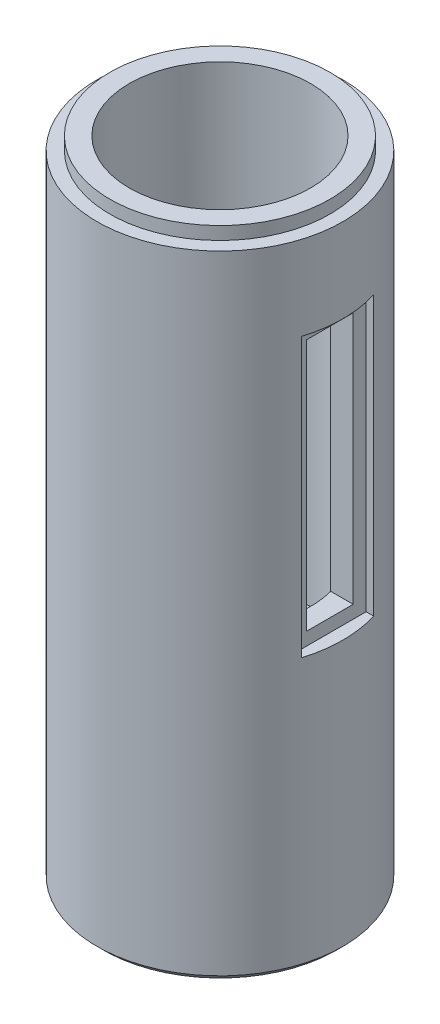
ISO-10303-21;
HEADER;
FILE_DESCRIPTION(('STEP AP214'),'2;1');
FILE_NAME('part.step','',(''),(''),'','','');
FILE_SCHEMA(('AUTOMOTIVE_DESIGN { 1 0 10303 214 1 1 1 1 }'));
ENDSEC;
DATA;
#1=APPLICATION_CONTEXT('core data for automotive mechanical design processes');
#2=APPLICATION_PROTOCOL_DEFINITION('international standard','automotive_design',2000,#1);
#3=PRODUCT_CONTEXT('',#1,'mechanical');
#4=PRODUCT('Part','Part','',(#3));
#5=PRODUCT_RELATED_PRODUCT_CATEGORY('part','',(#4));
#6=PRODUCT_DEFINITION_FORMATION('','',#4);
#7=PRODUCT_DEFINITION_CONTEXT('part definition',#1,'design');
#8=PRODUCT_DEFINITION('design','',#6,#7);
#9=PRODUCT_DEFINITION_SHAPE('','',#8);
#10=(LENGTH_UNIT() NAMED_UNIT(*) SI_UNIT(.MILLI.,.METRE.));
#11=(NAMED_UNIT(*) PLANE_ANGLE_UNIT() SI_UNIT($,.RADIAN.));
#12=(NAMED_UNIT(*) SI_UNIT($,.STERADIAN.) SOLID_ANGLE_UNIT());
#13=UNCERTAINTY_MEASURE_WITH_UNIT(LENGTH_MEASURE(1.E-05),#10,'distance_accuracy_value','');
#14=(GEOMETRIC_REPRESENTATION_CONTEXT(3) GLOBAL_UNCERTAINTY_ASSIGNED_CONTEXT((#13)) GLOBAL_UNIT_ASSIGNED_CONTEXT((#10,
#11,#12)) REPRESENTATION_CONTEXT('',''));
#15=CARTESIAN_POINT('',(0.,0.,0.));
#16=DIRECTION('',(0.,0.,1.));
#17=DIRECTION('',(1.,0.,0.));
#18=AXIS2_PLACEMENT_3D('',#15,#16,#17);
#19=CARTESIAN_POINT('',(0.,0.,0.));
#20=DIRECTION('',(0.,-1.,0.));
#21=DIRECTION('',(0.,0.,-1.));
#22=AXIS2_PLACEMENT_3D('',#19,#20,#21);
#23=CYLINDRICAL_SURFACE('',#22,19.);
#24=DIRECTION('',(0.,-1.,0.));
#25=VECTOR('',#24,1.);
#26=CARTESIAN_POINT('',(18.1598415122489,0.,5.58749999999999));
#27=LINE('',#26,#25);
#28=CARTESIAN_POINT('',(18.1598415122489,85.,5.58749999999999));
#29=VERTEX_POINT('',#28);
#30=CARTESIAN_POINT('',(18.1598415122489,42.,5.58749999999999));
#31=VERTEX_POINT('',#30);
#32=EDGE_CURVE('E11',#29,#31,#27,.T.);
#33=ORIENTED_EDGE('',*,*,#32,.F.);
#34=CARTESIAN_POINT('',(0.,85.,0.));
#35=DIRECTION('',(0.,-1.,0.));
#36=DIRECTION('',(0.,0.,-1.));
#37=AXIS2_PLACEMENT_3D('',#34,#35,#36);
#38=CIRCLE('',#37,19.);
#39=CARTESIAN_POINT('',(18.1598415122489,85.,-5.5875));
#40=VERTEX_POINT('',#39);
#41=EDGE_CURVE('E60',#29,#40,#38,.F.);
#42=ORIENTED_EDGE('',*,*,#41,.T.);
#43=DIRECTION('',(0.,-1.,0.));
#44=VECTOR('',#43,1.);
#45=CARTESIAN_POINT('',(18.1598415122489,0.,-5.5875));
#46=LINE('',#45,#44);
#47=CARTESIAN_POINT('',(18.1598415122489,42.,-5.5875));
#48=VERTEX_POINT('',#47);
#49=EDGE_CURVE('E131',#40,#48,#46,.T.);
#50=ORIENTED_EDGE('',*,*,#49,.T.);
#51=CARTESIAN_POINT('',(0.,42.,0.));
#52=DIRECTION('',(0.,-1.,0.));
#53=DIRECTION('',(0.,0.,-1.));
#54=AXIS2_PLACEMENT_3D('',#51,#52,#53);
#55=CIRCLE('',#54,19.);
#56=EDGE_CURVE('E53',#31,#48,#55,.F.);
#57=ORIENTED_EDGE('',*,*,#56,.F.);
#58=EDGE_LOOP('',(#33,#42,#50,#57));
#59=FACE_BOUND('',#58,.T.);
#60=CARTESIAN_POINT('',(0.,1.00000000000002,0.));
#61=DIRECTION('',(0.,-1.,0.));
#62=DIRECTION('',(0.,0.,-1.));
#63=AXIS2_PLACEMENT_3D('',#60,#61,#62);
#64=CIRCLE('',#63,19.);
#65=CARTESIAN_POINT('',(0.,1.00000000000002,-19.));
#66=VERTEX_POINT('',#65);
#67=EDGE_CURVE('E286',#66,#66,#64,.F.);
#68=ORIENTED_EDGE('',*,*,#67,.T.);
#69=EDGE_LOOP('',(#68));
#70=FACE_BOUND('',#69,.T.);
#71=CARTESIAN_POINT('',(-16.1554944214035,50.,10.));
#72=CARTESIAN_POINT('',(-16.1554939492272,49.7415393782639,10.0000004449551));
#73=CARTESIAN_POINT('',(-16.1617174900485,49.4830827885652,9.98996714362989));
#74=CARTESIAN_POINT('',(-16.1863660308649,48.9682056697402,9.94998001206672));
#75=CARTESIAN_POINT('',(-16.2047958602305,48.7117859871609,9.9200182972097));
#76=CARTESIAN_POINT('',(-16.2531781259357,48.2027520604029,9.84054659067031));
#77=CARTESIAN_POINT('',(-16.283146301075,47.9501435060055,9.7910098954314));
#78=CARTESIAN_POINT('',(-16.3535139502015,47.450770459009,9.67301866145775));
#79=CARTESIAN_POINT('',(-16.3939180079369,47.204008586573,9.6045558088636));
#80=CARTESIAN_POINT('',(-16.4834897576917,46.719483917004,9.4499990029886));
#81=CARTESIAN_POINT('',(-16.5326009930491,46.4816744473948,9.36401812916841));
#82=CARTESIAN_POINT('',(-16.6382633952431,46.0145768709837,9.17496123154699));
#83=CARTESIAN_POINT('',(-16.6948172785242,45.7852919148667,9.07187896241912));
#84=CARTESIAN_POINT('',(-16.8137605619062,45.3363755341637,8.84948290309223));
#85=CARTESIAN_POINT('',(-16.8761490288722,45.1167425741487,8.73017170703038));
#86=CARTESIAN_POINT('',(-17.0051833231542,44.6879309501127,8.4760864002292));
#87=CARTESIAN_POINT('',(-17.07182929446,44.4787526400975,8.34131176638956));
#88=CARTESIAN_POINT('',(-17.2140821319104,44.052854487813,8.04394033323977));
#89=CARTESIAN_POINT('',(-17.2899493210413,43.8372111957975,7.87992463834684));
#90=CARTESIAN_POINT('',(-17.4429455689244,43.4201835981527,7.53519821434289));
#91=CARTESIAN_POINT('',(-17.5200746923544,43.2188000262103,7.35448662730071));
#92=CARTESIAN_POINT('',(-17.6737626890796,42.8310677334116,6.97708029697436));
#93=CARTESIAN_POINT('',(-17.7503211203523,42.6447297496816,6.78037433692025));
#94=CARTESIAN_POINT('',(-17.9009675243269,42.288273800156,6.37202536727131));
#95=CARTESIAN_POINT('',(-17.9750563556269,42.1181501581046,6.16038763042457));
#96=CARTESIAN_POINT('',(-18.1246027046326,41.7826104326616,5.70615894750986));
#97=CARTESIAN_POINT('',(-18.1997255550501,41.6185679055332,5.46243953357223));
#98=CARTESIAN_POINT('',(-18.3430338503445,41.3117729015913,4.95997549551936));
#99=CARTESIAN_POINT('',(-18.4112188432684,41.1690218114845,4.70122989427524));
#100=CARTESIAN_POINT('',(-18.5386543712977,40.9063267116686,4.17045931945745));
#101=CARTESIAN_POINT('',(-18.5979096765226,40.7863705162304,3.89844153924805));
#102=CARTESIAN_POINT('',(-18.7057395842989,40.5706080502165,3.34295002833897));
#103=CARTESIAN_POINT('',(-18.7543154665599,40.4747988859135,3.05947767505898));
#104=CARTESIAN_POINT('',(-18.8359667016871,40.3150645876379,2.50569903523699));
#105=CARTESIAN_POINT('',(-18.8699509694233,40.2492452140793,2.23607260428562));
#106=CARTESIAN_POINT('',(-18.9265718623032,40.1401163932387,1.69112255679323));
#107=CARTESIAN_POINT('',(-18.9492090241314,40.0968058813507,1.41579921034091));
#108=CARTESIAN_POINT('',(-18.9824654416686,40.0333192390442,0.861934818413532));
#109=CARTESIAN_POINT('',(-18.9930915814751,40.013129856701,0.583395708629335));
#110=CARTESIAN_POINT('',(-19.0020311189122,39.99613856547,0.0254154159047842));
#111=CARTESIAN_POINT('',(-19.0003453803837,39.9993350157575,-0.254025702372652));
#112=CARTESIAN_POINT('',(-18.9854710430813,40.0276268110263,-0.784464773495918));
#113=CARTESIAN_POINT('',(-18.9734051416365,40.0505849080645,-1.0356117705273));
#114=CARTESIAN_POINT('',(-18.9395611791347,40.1152774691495,-1.53479379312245));
#115=CARTESIAN_POINT('',(-18.9177838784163,40.1570104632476,-1.7828290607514));
#116=CARTESIAN_POINT('',(-18.8650322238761,40.2587818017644,-2.27411651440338));
#117=CARTESIAN_POINT('',(-18.8340575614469,40.3188207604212,-2.51736853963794));
#118=CARTESIAN_POINT('',(-18.7636238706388,40.4565687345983,-2.99755221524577));
#119=CARTESIAN_POINT('',(-18.7241645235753,40.5342784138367,-3.23448362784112));
#120=CARTESIAN_POINT('',(-18.6371017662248,40.7076774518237,-3.70351242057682));
#121=CARTESIAN_POINT('',(-18.589404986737,40.803574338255,-3.93551573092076));
#122=CARTESIAN_POINT('',(-18.4872422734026,41.0118780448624,-4.39048138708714));
#123=CARTESIAN_POINT('',(-18.4327739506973,41.1242906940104,-4.61344050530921));
#124=CARTESIAN_POINT('',(-18.2609083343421,41.4849727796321,-5.26704267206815));
#125=CARTESIAN_POINT('',(-18.1349950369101,41.7567933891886,-5.68269725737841));
#126=CARTESIAN_POINT('',(-17.8569413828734,42.3869701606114,-6.50673718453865));
#127=CARTESIAN_POINT('',(-17.7034360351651,42.7513159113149,-6.91008319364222));
#128=CARTESIAN_POINT('',(-17.4724880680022,43.3426191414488,-7.46677942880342));
#129=CARTESIAN_POINT('',(-17.3953285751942,43.547365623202,-7.64441344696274));
#130=CARTESIAN_POINT('',(-17.2426495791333,43.9710667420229,-7.98282141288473));
#131=CARTESIAN_POINT('',(-17.1671303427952,44.1900236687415,-8.14359263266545));
#132=CARTESIAN_POINT('',(-17.0141317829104,44.6583422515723,-8.45886165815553));
#133=CARTESIAN_POINT('',(-16.936941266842,44.9087494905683,-8.61194899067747));
#134=CARTESIAN_POINT('',(-16.7893874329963,45.4235078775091,-8.89618490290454));
#135=CARTESIAN_POINT('',(-16.719021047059,45.6878526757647,-9.02734336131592));
#136=CARTESIAN_POINT('',(-16.5877126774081,46.2289232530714,-9.26641209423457));
#137=CARTESIAN_POINT('',(-16.5267646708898,46.505640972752,-9.37433724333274));
#138=CARTESIAN_POINT('',(-16.4167626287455,47.069719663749,-9.56567355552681));
#139=CARTESIAN_POINT('',(-16.3677068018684,47.3570790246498,-9.64908841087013));
#140=CARTESIAN_POINT('',(-16.2871340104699,47.9164875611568,-9.78442427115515));
#141=CARTESIAN_POINT('',(-16.2545190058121,48.1878939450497,-9.83834758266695));
#142=CARTESIAN_POINT('',(-16.2026141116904,48.7355023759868,-9.92359841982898));
#143=CARTESIAN_POINT('',(-16.1833234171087,49.0117041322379,-9.95492731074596));
#144=CARTESIAN_POINT('',(-16.1589467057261,49.5661718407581,-9.99444769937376));
#145=CARTESIAN_POINT('',(-16.1538496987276,49.8444360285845,-10.002657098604));
#146=CARTESIAN_POINT('',(-16.1580679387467,50.4005565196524,-9.99584231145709));
#147=CARTESIAN_POINT('',(-16.167381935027,50.6784128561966,-9.98082014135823));
#148=CARTESIAN_POINT('',(-16.1978940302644,51.1957036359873,-9.93120984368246));
#149=CARTESIAN_POINT('',(-16.2174200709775,51.4355075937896,-9.89936948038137));
#150=CARTESIAN_POINT('',(-16.2664357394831,51.9112652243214,-9.81862006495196));
#151=CARTESIAN_POINT('',(-16.2959286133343,52.1472176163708,-9.76970545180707));
#152=CARTESIAN_POINT('',(-16.3639338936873,52.6137296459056,-9.65536549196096));
#153=CARTESIAN_POINT('',(-16.4024454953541,52.8442897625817,-9.58994161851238));
#154=CARTESIAN_POINT('',(-16.4873442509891,53.298858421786,-9.44323285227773));
#155=CARTESIAN_POINT('',(-16.5337345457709,53.5228643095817,-9.361941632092));
#156=CARTESIAN_POINT('',(-16.6872649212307,54.2029989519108,-9.08738309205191));
#157=CARTESIAN_POINT('',(-16.8055910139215,54.6465402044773,-8.86850653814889));
#158=CARTESIAN_POINT('',(-17.0590424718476,55.4931541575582,-8.37059432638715));
#159=CARTESIAN_POINT('',(-17.1941764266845,55.8962059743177,-8.09152785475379));
#160=CARTESIAN_POINT('',(-17.4104012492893,56.4933025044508,-7.61018272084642));
#161=CARTESIAN_POINT('',(-17.489857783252,56.7029466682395,-7.42618673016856));
#162=CARTESIAN_POINT('',(-17.6483371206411,57.1062075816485,-7.04126843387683));
#163=CARTESIAN_POINT('',(-17.7273600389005,57.2998287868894,-6.84035086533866));
#164=CARTESIAN_POINT('',(-17.8830482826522,57.6701805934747,-6.42233435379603));
#165=CARTESIAN_POINT('',(-17.959711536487,57.8468966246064,-6.20522173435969));
#166=CARTESIAN_POINT('',(-18.1086648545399,58.1820701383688,-5.75605848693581));
#167=CARTESIAN_POINT('',(-18.1809567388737,58.3405352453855,-5.52401416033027));
#168=CARTESIAN_POINT('',(-18.3220311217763,58.6438148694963,-5.03685547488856));
#169=CARTESIAN_POINT('',(-18.3905719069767,58.7878705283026,-4.78119718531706));
#170=CARTESIAN_POINT('',(-18.5190628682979,59.0536859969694,-4.25643860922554));
#171=CARTESIAN_POINT('',(-18.5790126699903,59.1754448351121,-3.98733773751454));
#172=CARTESIAN_POINT('',(-18.6885020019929,59.3951676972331,-3.43777843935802));
#173=CARTESIAN_POINT('',(-18.7380496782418,59.4931503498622,-3.15732910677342));
#174=CARTESIAN_POINT('',(-18.8252475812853,59.6641276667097,-2.58712030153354));
#175=CARTESIAN_POINT('',(-18.8628994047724,59.7371256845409,-2.29736208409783));
#176=CARTESIAN_POINT('',(-18.9220542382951,59.8512062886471,-1.73972820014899));
#177=CARTESIAN_POINT('',(-18.9447740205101,59.8947070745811,-1.47247424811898));
#178=CARTESIAN_POINT('',(-18.9789120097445,59.9599135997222,-0.934606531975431));
#179=CARTESIAN_POINT('',(-18.9903309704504,59.9816207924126,-0.663992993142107));
#180=CARTESIAN_POINT('',(-19.001544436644,60.0029381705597,-0.121757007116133));
#181=CARTESIAN_POINT('',(-19.0013431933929,60.0025564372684,0.149865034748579));
#182=CARTESIAN_POINT('',(-18.989332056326,59.9797208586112,0.691915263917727));
#183=CARTESIAN_POINT('',(-18.9775226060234,59.9572678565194,0.962343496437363));
#184=CARTESIAN_POINT('',(-18.9439918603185,59.8932048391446,1.47879879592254));
#185=CARTESIAN_POINT('',(-18.9231145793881,59.8532238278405,1.72508531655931));
#186=CARTESIAN_POINT('',(-18.8722683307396,59.7552174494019,2.21306535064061));
#187=CARTESIAN_POINT('',(-18.8422999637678,59.6971932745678,2.45475916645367));
#188=CARTESIAN_POINT('',(-18.7739537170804,59.5637137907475,2.9320264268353));
#189=CARTESIAN_POINT('',(-18.7355766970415,59.4882602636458,3.16760049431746));
#190=CARTESIAN_POINT('',(-18.6512331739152,59.3206087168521,3.63140293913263));
#191=CARTESIAN_POINT('',(-18.6052637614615,59.2284042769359,3.85962846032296));
#192=CARTESIAN_POINT('',(-18.504804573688,59.0241895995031,4.31612266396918));
#193=CARTESIAN_POINT('',(-18.4500545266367,58.9115525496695,4.54405339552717));
#194=CARTESIAN_POINT('',(-18.3345802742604,58.6699535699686,4.98960500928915));
#195=CARTESIAN_POINT('',(-18.2738538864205,58.5409856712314,5.20722208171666));
#196=CARTESIAN_POINT('',(-18.1477017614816,58.2676346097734,5.63114884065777));
#197=CARTESIAN_POINT('',(-18.0822753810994,58.1232493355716,5.8374569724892));
#198=CARTESIAN_POINT('',(-17.9480570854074,57.8199265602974,6.23793711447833));
#199=CARTESIAN_POINT('',(-17.8792648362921,57.660987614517,6.43210791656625));
#200=CARTESIAN_POINT('',(-17.7321442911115,57.3114111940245,6.82790748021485));
#201=CARTESIAN_POINT('',(-17.6535897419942,57.1192047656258,7.02806882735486));
#202=CARTESIAN_POINT('',(-17.4960044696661,56.7189299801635,7.41166893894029));
#203=CARTESIAN_POINT('',(-17.4169737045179,56.5108602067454,7.59510620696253));
#204=CARTESIAN_POINT('',(-17.2603958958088,56.0796108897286,7.94452176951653));
#205=CARTESIAN_POINT('',(-17.1828505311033,55.8564154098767,8.11048116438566));
#206=CARTESIAN_POINT('',(-17.0314664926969,55.3961171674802,8.42374124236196));
#207=CARTESIAN_POINT('',(-16.9576275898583,55.1590152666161,8.57104307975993));
#208=CARTESIAN_POINT('',(-16.812368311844,54.6599842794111,8.85271757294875));
#209=CARTESIAN_POINT('',(-16.7412446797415,54.3974077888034,8.98610034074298));
#210=CARTESIAN_POINT('',(-16.608068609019,53.8595103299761,9.22991742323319));
#211=CARTESIAN_POINT('',(-16.5460177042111,53.58418721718,9.34034785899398));
#212=CARTESIAN_POINT('',(-16.4336892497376,53.023465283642,9.53659387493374));
#213=CARTESIAN_POINT('',(-16.3833783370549,52.7380977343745,9.62247936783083));
#214=CARTESIAN_POINT('',(-16.296607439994,52.1589902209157,9.76871785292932));
#215=CARTESIAN_POINT('',(-16.2601381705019,51.8652560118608,9.82908796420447));
#216=CARTESIAN_POINT('',(-16.2064894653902,51.3101704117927,9.91725716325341));
#217=CARTESIAN_POINT('',(-16.1874347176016,51.0495026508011,9.9482426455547));
#218=CARTESIAN_POINT('',(-16.1619371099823,50.5258886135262,9.98961436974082));
#219=CARTESIAN_POINT('',(-16.1554949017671,50.2629422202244,9.99999954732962));
#220=CARTESIAN_POINT('',(-16.1554944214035,50.,10.));
#221=B_SPLINE_CURVE_WITH_KNOTS('',3,(#71,#72,#73,#74,#75,#76,#77,#78,#79,#80,#81,#82,#83,#84,
#85,#86,#87,#88,#89,#90,#91,#92,#93,#94,#95,#96,#97,#98,#99,#100,#101,#102,#103,#104,#105,#106,
#107,#108,#109,#110,#111,#112,#113,#114,#115,#116,#117,#118,#119,#120,#121,#122,#123,#124,#125,
#126,#127,#128,#129,#130,#131,#132,#133,#134,#135,#136,#137,#138,#139,#140,#141,#142,#143,#144,
#145,#146,#147,#148,#149,#150,#151,#152,#153,#154,#155,#156,#157,#158,#159,#160,#161,#162,#163,
#164,#165,#166,#167,#168,#169,#170,#171,#172,#173,#174,#175,#176,#177,#178,#179,#180,#181,#182,
#183,#184,#185,#186,#187,#188,#189,#190,#191,#192,#193,#194,#195,#196,#197,#198,#199,#200,#201,
#202,#203,#204,#205,#206,#207,#208,#209,#210,#211,#212,#213,#214,#215,#216,#217,#218,#219,#220),
.UNSPECIFIED.,.T.,.F.,(4,2,2,2,2,2,2,2,2,2,2,2,2,2,2,2,2,2,2,2,2,2,2,2,2,2,2,2,2,2,2,2,2,2,2,2,
2,2,2,2,2,2,2,2,2,2,2,2,2,2,2,2,2,2,2,2,2,2,2,2,2,2,2,2,2,2,2,2,2,2,2,2,2,2,4),(0.,
0.775108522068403,1.550523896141,2.3270007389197,3.10381921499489,3.87577372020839,
4.64801076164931,5.4201245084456,6.19226438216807,7.03543828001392,7.8786555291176,
8.72246930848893,9.56598659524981,10.4745204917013,11.3831135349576,12.2912194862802,
13.1992165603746,14.0369141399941,14.87457209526,15.7117497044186,16.5488685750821,
17.3054196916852,18.0619115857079,18.8184288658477,19.5749745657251,20.3407379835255,
21.1067723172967,22.6379179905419,24.3247975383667,25.1695866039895,26.0145121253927,
26.9237916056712,27.8326603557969,28.7409454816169,29.6490937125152,30.4837531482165,
31.3183621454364,32.1523247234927,32.9862149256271,33.7134669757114,34.4409561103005,
35.1683803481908,35.8960952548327,37.4154828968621,38.9356502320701,39.8049296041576,
40.6739664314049,41.5437456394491,42.4131601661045,43.3159941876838,44.2188675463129,
45.1210312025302,46.0230737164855,46.8371475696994,47.6511671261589,48.4648888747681,
49.2785795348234,50.0288686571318,50.7791082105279,51.529271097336,52.2797221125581,
53.0591221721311,53.838807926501,54.6186005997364,55.3984707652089,56.2627490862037,
57.1271046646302,57.9923855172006,58.8576128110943,59.7653211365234,60.6731827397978,
61.5784320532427,62.4830730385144,63.2715808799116,64.0601294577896),.UNSPECIFIED.);
#222=CARTESIAN_POINT('',(-16.1554944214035,50.,10.));
#223=VERTEX_POINT('',#222);
#224=EDGE_CURVE('E147',#223,#223,#221,.T.);
#225=ORIENTED_EDGE('',*,*,#224,.T.);
#226=EDGE_LOOP('',(#225));
#227=FACE_BOUND('',#226,.T.);
#228=CARTESIAN_POINT('',(0.,98.,0.));
#229=DIRECTION('',(0.,-1.,0.));
#230=DIRECTION('',(0.,0.,-1.));
#231=AXIS2_PLACEMENT_3D('',#228,#229,#230);
#232=CIRCLE('',#231,19.);
#233=CARTESIAN_POINT('',(0.,98.,-19.));
#234=VERTEX_POINT('',#233);
#235=EDGE_CURVE('E127',#234,#234,#232,.T.);
#236=ORIENTED_EDGE('',*,*,#235,.T.);
#237=EDGE_LOOP('',(#236));
#238=FACE_BOUND('',#237,.T.);
#239=ADVANCED_FACE('F44',(#59,#70,#227,#238),#23,.T.);
#240=CARTESIAN_POINT('',(0.,100.,0.));
#241=DIRECTION('',(0.,1.,0.));
#242=DIRECTION('',(0.,0.,1.));
#243=AXIS2_PLACEMENT_3D('',#240,#241,#242);
#244=PLANE('',#243);
#245=CARTESIAN_POINT('',(0.,100.,0.));
#246=DIRECTION('',(0.,-1.,0.));
#247=DIRECTION('',(0.,0.,-1.));
#248=AXIS2_PLACEMENT_3D('',#245,#246,#247);
#249=CIRCLE('',#248,14.);
#250=CARTESIAN_POINT('',(0.,100.,-14.));
#251=VERTEX_POINT('',#250);
#252=EDGE_CURVE('E279',#251,#251,#249,.T.);
#253=ORIENTED_EDGE('',*,*,#252,.T.);
#254=EDGE_LOOP('',(#253));
#255=FACE_BOUND('',#254,.T.);
#256=CARTESIAN_POINT('',(0.,100.,0.));
#257=DIRECTION('',(0.,-1.,0.));
#258=DIRECTION('',(0.,0.,-1.));
#259=AXIS2_PLACEMENT_3D('',#256,#257,#258);
#260=CIRCLE('',#259,17.);
#261=CARTESIAN_POINT('',(0.,100.,-17.));
#262=VERTEX_POINT('',#261);
#263=EDGE_CURVE('E303',#262,#262,#260,.T.);
#264=ORIENTED_EDGE('',*,*,#263,.F.);
#265=EDGE_LOOP('',(#264));
#266=FACE_BOUND('',#265,.T.);
#267=ADVANCED_FACE('F228',(#255,#266),#244,.T.);
#268=CARTESIAN_POINT('',(0.,0.,0.));
#269=DIRECTION('',(0.,-1.,0.));
#270=DIRECTION('',(0.,0.,-1.));
#271=AXIS2_PLACEMENT_3D('',#268,#269,#270);
#272=CYLINDRICAL_SURFACE('',#271,14.);
#273=CARTESIAN_POINT('',(0.,30.,0.));
#274=DIRECTION('',(0.,-1.,0.));
#275=DIRECTION('',(0.,0.,-1.));
#276=AXIS2_PLACEMENT_3D('',#273,#274,#275);
#277=CIRCLE('',#276,14.);
#278=CARTESIAN_POINT('',(0.,30.,-14.));
#279=VERTEX_POINT('',#278);
#280=EDGE_CURVE('E257',#279,#279,#277,.T.);
#281=ORIENTED_EDGE('',*,*,#280,.T.);
#282=EDGE_LOOP('',(#281));
#283=FACE_BOUND('',#282,.T.);
#284=ORIENTED_EDGE('',*,*,#252,.F.);
#285=EDGE_LOOP('',(#284));
#286=FACE_BOUND('',#285,.T.);
#287=CARTESIAN_POINT('',(-9.79795897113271,50.,10.));
#288=CARTESIAN_POINT('',(-9.79795815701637,49.7617761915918,10.000000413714));
#289=CARTESIAN_POINT('',(-9.8066890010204,49.5235570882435,9.99146857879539));
#290=CARTESIAN_POINT('',(-9.84110892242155,49.049571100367,9.95756740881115));
#291=CARTESIAN_POINT('',(-9.86679850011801,48.8138042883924,9.93219757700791));
#292=CARTESIAN_POINT('',(-9.93381514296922,48.3464244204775,9.86516839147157));
#293=CARTESIAN_POINT('',(-9.97517221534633,48.1148202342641,9.82347777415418));
#294=CARTESIAN_POINT('',(-10.0715520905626,47.6577508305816,9.72463836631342));
#295=CARTESIAN_POINT('',(-10.126582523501,47.4322891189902,9.66748094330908));
#296=CARTESIAN_POINT('',(-10.2472878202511,46.9914577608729,9.53942950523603));
#297=CARTESIAN_POINT('',(-10.3128241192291,46.7759983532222,9.46871223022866));
#298=CARTESIAN_POINT('',(-10.4527885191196,46.3529996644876,9.31397479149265));
#299=CARTESIAN_POINT('',(-10.5272158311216,46.1454596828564,9.22995580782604));
#300=CARTESIAN_POINT('',(-10.760685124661,45.5352703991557,8.95902972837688));
#301=CARTESIAN_POINT('',(-10.9300057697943,45.1447390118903,8.75316092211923));
#302=CARTESIAN_POINT('',(-11.2096470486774,44.5507757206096,8.3888730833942));
#303=CARTESIAN_POINT('',(-11.315892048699,44.335953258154,8.24530618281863));
#304=CARTESIAN_POINT('',(-11.5304420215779,43.9186229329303,7.94249847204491));
#305=CARTESIAN_POINT('',(-11.6387471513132,43.7161160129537,7.78325646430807));
#306=CARTESIAN_POINT('',(-11.8552365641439,43.3236652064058,7.44936410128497));
#307=CARTESIAN_POINT('',(-11.9634205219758,43.1337375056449,7.27469454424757));
#308=CARTESIAN_POINT('',(-12.1774440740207,42.7672787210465,6.91046166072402));
#309=CARTESIAN_POINT('',(-12.2832834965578,42.5907486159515,6.7208972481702));
#310=CARTESIAN_POINT('',(-12.5089781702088,42.2218616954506,6.29237694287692));
#311=CARTESIAN_POINT('',(-12.6279991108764,42.032232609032,6.05061706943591));
#312=CARTESIAN_POINT('',(-12.8568919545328,41.6742204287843,5.5476727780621));
#313=CARTESIAN_POINT('',(-12.9667620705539,41.5058414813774,5.28648458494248));
#314=CARTESIAN_POINT('',(-13.1740694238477,41.1926247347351,4.74630809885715));
#315=CARTESIAN_POINT('',(-13.271527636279,41.0477471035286,4.46735106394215));
#316=CARTESIAN_POINT('',(-13.4512096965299,40.7834694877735,3.89299040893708));
#317=CARTESIAN_POINT('',(-13.533440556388,40.6640577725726,3.59759444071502));
#318=CARTESIAN_POINT('',(-13.659516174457,40.4823653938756,3.07702568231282));
#319=CARTESIAN_POINT('',(-13.7076745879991,40.4134341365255,2.85519284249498));
#320=CARTESIAN_POINT('',(-13.793706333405,40.2908162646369,2.40541999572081));
#321=CARTESIAN_POINT('',(-13.8315819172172,40.237126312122,2.17748133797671));
#322=CARTESIAN_POINT('',(-13.8962531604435,40.1457169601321,1.71702273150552));
#323=CARTESIAN_POINT('',(-13.9230558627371,40.1079874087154,1.48450579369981));
#324=CARTESIAN_POINT('',(-13.9650382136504,40.0489838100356,1.01633582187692));
#325=CARTESIAN_POINT('',(-13.9802174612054,40.027710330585,0.780682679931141));
#326=CARTESIAN_POINT('',(-13.9986296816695,40.0019144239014,0.307486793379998));
#327=CARTESIAN_POINT('',(-14.0018370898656,39.9974278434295,0.0699410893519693));
#328=CARTESIAN_POINT('',(-13.9961614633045,40.0053742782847,-0.404720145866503));
#329=CARTESIAN_POINT('',(-13.9872784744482,40.0178072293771,-0.64183567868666));
#330=CARTESIAN_POINT('',(-13.9576213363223,40.0594061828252,-1.11389055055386));
#331=CARTESIAN_POINT('',(-13.9368445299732,40.088575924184,-1.34882939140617));
#332=CARTESIAN_POINT('',(-13.8838591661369,40.163220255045,-1.81478339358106));
#333=CARTESIAN_POINT('',(-13.8516506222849,40.2086948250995,-2.04579855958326));
#334=CARTESIAN_POINT('',(-13.7774770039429,40.3139158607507,-2.49637525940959));
#335=CARTESIAN_POINT('',(-13.735790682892,40.3732556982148,-2.71607824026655));
#336=CARTESIAN_POINT('',(-13.6430081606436,40.5061107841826,-3.14919020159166));
#337=CARTESIAN_POINT('',(-13.5919086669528,40.5796309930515,-3.36259694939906));
#338=CARTESIAN_POINT('',(-13.4812338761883,40.7400304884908,-3.78197811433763));
#339=CARTESIAN_POINT('',(-13.4216608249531,40.8269062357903,-3.98795448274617));
#340=CARTESIAN_POINT('',(-13.2949935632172,41.0132583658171,-4.39180555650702));
#341=CARTESIAN_POINT('',(-13.2278966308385,41.1127393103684,-4.58967729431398));
#342=CARTESIAN_POINT('',(-13.0794106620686,41.3352096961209,-4.99813293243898));
#343=CARTESIAN_POINT('',(-12.9972619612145,41.4595830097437,-5.20768694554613));
#344=CARTESIAN_POINT('',(-12.8263924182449,41.7219412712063,-5.61538445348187));
#345=CARTESIAN_POINT('',(-12.7376687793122,41.8599320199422,-5.81352302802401));
#346=CARTESIAN_POINT('',(-12.5550966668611,42.1486958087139,-6.19797213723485));
#347=CARTESIAN_POINT('',(-12.4612448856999,42.2994771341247,-6.38427486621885));
#348=CARTESIAN_POINT('',(-12.2699725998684,42.6130075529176,-6.74458196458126));
#349=CARTESIAN_POINT('',(-12.1725517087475,42.7757579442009,-6.91858499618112));
#350=CARTESIAN_POINT('',(-11.9575301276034,43.143706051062,-7.284950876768));
#351=CARTESIAN_POINT('',(-11.8395220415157,43.3511957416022,-7.47477932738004));
#352=CARTESIAN_POINT('',(-11.6033885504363,43.7814013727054,-7.83632589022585));
#353=CARTESIAN_POINT('',(-11.4852631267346,44.0041203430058,-8.0080403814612));
#354=CARTESIAN_POINT('',(-11.2518901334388,44.4642649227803,-8.3327631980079));
#355=CARTESIAN_POINT('',(-11.1366427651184,44.7016915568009,-8.48577021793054));
#356=CARTESIAN_POINT('',(-10.9124156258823,45.1908371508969,-8.77224311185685));
#357=CARTESIAN_POINT('',(-10.8034341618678,45.4425522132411,-8.9057142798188));
#358=CARTESIAN_POINT('',(-10.6190211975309,45.9015560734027,-9.12425280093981));
#359=CARTESIAN_POINT('',(-10.5415642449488,46.1060706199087,-9.21344943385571));
#360=CARTESIAN_POINT('',(-10.3947060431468,46.5232161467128,-9.37882278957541));
#361=CARTESIAN_POINT('',(-10.3253069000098,46.7358492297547,-9.45499611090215));
#362=CARTESIAN_POINT('',(-10.1968549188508,47.1683222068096,-9.59338634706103));
#363=CARTESIAN_POINT('',(-10.13778719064,47.3881511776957,-9.65562338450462));
#364=CARTESIAN_POINT('',(-10.0321175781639,47.8342910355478,-9.76536890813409));
#365=CARTESIAN_POINT('',(-9.98550858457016,48.0605981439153,-9.81288579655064));
#366=CARTESIAN_POINT('',(-9.90629309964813,48.5212472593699,-9.8928551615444));
#367=CARTESIAN_POINT('',(-9.87386450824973,48.7556536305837,-9.92511663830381));
#368=CARTESIAN_POINT('',(-9.82553090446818,49.2278693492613,-9.97296921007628));
#369=CARTESIAN_POINT('',(-9.80962505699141,49.4656785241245,-9.98856114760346));
#370=CARTESIAN_POINT('',(-9.79523692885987,49.9421952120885,-10.0026715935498));
#371=CARTESIAN_POINT('',(-9.79674428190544,50.1809021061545,-10.0012002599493));
#372=CARTESIAN_POINT('',(-9.81707266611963,50.6568420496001,-9.98124665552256));
#373=CARTESIAN_POINT('',(-9.83589262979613,50.8940751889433,-9.96276543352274));
#374=CARTESIAN_POINT('',(-9.8855063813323,51.327395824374,-9.91351362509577));
#375=CARTESIAN_POINT('',(-9.91392696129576,51.5240402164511,-9.88515777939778));
#376=CARTESIAN_POINT('',(-9.98122963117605,51.9135833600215,-9.81719599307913));
#377=CARTESIAN_POINT('',(-10.0201154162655,52.1064807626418,-9.77758607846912));
#378=CARTESIAN_POINT('',(-10.15068488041,52.6784382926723,-9.64257790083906));
#379=CARTESIAN_POINT('',(-10.2562693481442,53.0506732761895,-9.53101182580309));
#380=CARTESIAN_POINT('',(-10.4625910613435,53.6782765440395,-9.30329098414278));
#381=CARTESIAN_POINT('',(-10.5574792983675,53.9389102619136,-9.19583583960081));
#382=CARTESIAN_POINT('',(-10.7574523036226,54.4471680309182,-8.96108269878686));
#383=CARTESIAN_POINT('',(-10.8625413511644,54.6947865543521,-8.83377636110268));
#384=CARTESIAN_POINT('',(-11.0793932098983,55.1768137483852,-8.56023145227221));
#385=CARTESIAN_POINT('',(-11.1911668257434,55.4111997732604,-8.41396175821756));
#386=CARTESIAN_POINT('',(-11.4180134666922,55.8659910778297,-8.10345228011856));
#387=CARTESIAN_POINT('',(-11.5330860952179,56.0863980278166,-7.93921464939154));
#388=CARTESIAN_POINT('',(-11.7663233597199,56.5176686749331,-7.58938932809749));
#389=CARTESIAN_POINT('',(-11.8844988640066,56.7282019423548,-7.4034014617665));
#390=CARTESIAN_POINT('',(-12.1185878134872,57.1335501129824,-7.01366585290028));
#391=CARTESIAN_POINT('',(-12.2345010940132,57.3283638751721,-6.80991682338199));
#392=CARTESIAN_POINT('',(-12.4613242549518,57.7010669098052,-6.38539334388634));
#393=CARTESIAN_POINT('',(-12.5722400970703,57.8789766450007,-6.16464007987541));
#394=CARTESIAN_POINT('',(-12.7867142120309,58.2168788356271,-5.70647765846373));
#395=CARTESIAN_POINT('',(-12.8902737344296,58.3768743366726,-5.46907134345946));
#396=CARTESIAN_POINT('',(-13.0729939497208,58.6551999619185,-5.0147379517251));
#397=CARTESIAN_POINT('',(-13.1534973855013,58.7761920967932,-4.79997942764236));
#398=CARTESIAN_POINT('',(-13.3059127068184,59.0030199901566,-4.35969401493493));
#399=CARTESIAN_POINT('',(-13.3778261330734,59.1088584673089,-4.13416906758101));
#400=CARTESIAN_POINT('',(-13.511621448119,59.3042453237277,-3.67336631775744));
#401=CARTESIAN_POINT('',(-13.573506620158,59.3937990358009,-3.43809173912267));
#402=CARTESIAN_POINT('',(-13.6859390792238,59.5555381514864,-2.95898729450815));
#403=CARTESIAN_POINT('',(-13.7364862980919,59.6277234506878,-2.71515737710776));
#404=CARTESIAN_POINT('',(-13.8253489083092,59.7540917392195,-2.2189324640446));
#405=CARTESIAN_POINT('',(-13.8635826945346,59.8081547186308,-1.96649211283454));
#406=CARTESIAN_POINT('',(-13.926398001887,59.8967438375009,-1.45651429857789));
#407=CARTESIAN_POINT('',(-13.9509794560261,59.9312698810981,-1.19897681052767));
#408=CARTESIAN_POINT('',(-13.9858273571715,59.9801633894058,-0.681136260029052));
#409=CARTESIAN_POINT('',(-13.9960998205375,59.994539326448,-0.420834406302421));
#410=CARTESIAN_POINT('',(-14.0020648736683,60.0028911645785,0.10025093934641));
#411=CARTESIAN_POINT('',(-13.9977587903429,59.9968689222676,0.361034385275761));
#412=CARTESIAN_POINT('',(-13.9759361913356,59.9662874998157,0.852705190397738));
#413=CARTESIAN_POINT('',(-13.9598906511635,59.943792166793,1.08379067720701));
#414=CARTESIAN_POINT('',(-13.9166417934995,59.8829842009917,1.5427924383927));
#415=CARTESIAN_POINT('',(-13.8894394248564,59.8446729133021,1.7707089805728));
#416=CARTESIAN_POINT('',(-13.8244382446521,59.7527507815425,2.22190727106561));
#417=CARTESIAN_POINT('',(-13.786638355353,59.6991383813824,2.44518854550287));
#418=CARTESIAN_POINT('',(-13.701189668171,59.5772899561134,2.88578796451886));
#419=CARTESIAN_POINT('',(-13.6535404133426,59.509053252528,3.1031058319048));
#420=CARTESIAN_POINT('',(-13.5480604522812,59.3569768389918,3.53563923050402));
#421=CARTESIAN_POINT('',(-13.490019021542,59.2728116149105,3.75068877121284));
#422=CARTESIAN_POINT('',(-13.3655853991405,59.0908342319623,4.17247418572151));
#423=CARTESIAN_POINT('',(-13.2991902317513,58.9930172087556,4.37920706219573));
#424=CARTESIAN_POINT('',(-13.089179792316,58.6804696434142,4.98558680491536));
#425=CARTESIAN_POINT('',(-12.9346606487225,58.4465307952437,5.37172818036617));
#426=CARTESIAN_POINT('',(-12.580486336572,57.8943296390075,6.16001536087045));
#427=CARTESIAN_POINT('',(-12.3775451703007,57.5686277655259,6.55545257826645));
#428=CARTESIAN_POINT('',(-12.0644707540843,57.0406984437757,7.1058717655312));
#429=CARTESIAN_POINT('',(-11.9585247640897,56.8578946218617,7.2824246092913));
#430=CARTESIAN_POINT('',(-11.745729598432,56.4797091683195,7.62087452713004));
#431=CARTESIAN_POINT('',(-11.6388806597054,56.2843307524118,7.78277532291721));
#432=CARTESIAN_POINT('',(-11.4080332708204,55.8466676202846,8.11819324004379));
#433=CARTESIAN_POINT('',(-11.2842550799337,55.6021043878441,8.28889857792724));
#434=CARTESIAN_POINT('',(-11.0420708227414,55.0967192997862,8.60888742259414));
#435=CARTESIAN_POINT('',(-10.9236661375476,54.8358933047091,8.75816544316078));
#436=CARTESIAN_POINT('',(-10.6967233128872,54.2987243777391,9.03393280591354));
#437=CARTESIAN_POINT('',(-10.5881721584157,54.0224027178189,9.16045243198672));
#438=CARTESIAN_POINT('',(-10.4364473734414,53.5968003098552,9.33201002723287));
#439=CARTESIAN_POINT('',(-10.3877299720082,53.453104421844,9.38615140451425));
#440=CARTESIAN_POINT('',(-10.2946367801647,53.162051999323,9.48816197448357));
#441=CARTESIAN_POINT('',(-10.2502625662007,53.0146941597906,9.53602889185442));
#442=CARTESIAN_POINT('',(-10.1446117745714,52.6383147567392,9.64860402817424));
#443=CARTESIAN_POINT('',(-10.0866844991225,52.4070165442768,9.70896916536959));
#444=CARTESIAN_POINT('',(-9.98511492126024,51.9377656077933,9.81339923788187));
#445=CARTESIAN_POINT('',(-9.94146687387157,51.699815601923,9.85747072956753));
#446=CARTESIAN_POINT('',(-9.87071722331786,51.2195403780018,9.92831611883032));
#447=CARTESIAN_POINT('',(-9.84357190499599,50.9772284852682,9.95513572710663));
#448=CARTESIAN_POINT('',(-9.80719375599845,50.4899426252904,9.99097690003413));
#449=CARTESIAN_POINT('',(-9.79795980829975,50.2449688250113,9.99999957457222));
#450=CARTESIAN_POINT('',(-9.79795897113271,50.,10.));
#451=B_SPLINE_CURVE_WITH_KNOTS('',3,(#287,#288,#289,#290,#291,#292,#293,#294,#295,#296,#297,
#298,#299,#300,#301,#302,#303,#304,#305,#306,#307,#308,#309,#310,#311,#312,#313,#314,#315,#316,
#317,#318,#319,#320,#321,#322,#323,#324,#325,#326,#327,#328,#329,#330,#331,#332,#333,#334,#335,
#336,#337,#338,#339,#340,#341,#342,#343,#344,#345,#346,#347,#348,#349,#350,#351,#352,#353,#354,
#355,#356,#357,#358,#359,#360,#361,#362,#363,#364,#365,#366,#367,#368,#369,#370,#371,#372,#373,
#374,#375,#376,#377,#378,#379,#380,#381,#382,#383,#384,#385,#386,#387,#388,#389,#390,#391,#392,
#393,#394,#395,#396,#397,#398,#399,#400,#401,#402,#403,#404,#405,#406,#407,#408,#409,#410,#411,
#412,#413,#414,#415,#416,#417,#418,#419,#420,#421,#422,#423,#424,#425,#426,#427,#428,#429,#430,
#431,#432,#433,#434,#435,#436,#437,#438,#439,#440,#441,#442,#443,#444,#445,#446,#447,#448,#449,
#450),.UNSPECIFIED.,.T.,.F.,(4,2,2,2,2,2,2,2,2,2,2,2,2,2,2,2,2,2,2,2,2,2,2,2,2,2,2,2,2,2,2,2,2,
2,2,2,2,2,2,2,2,2,2,2,2,2,2,2,2,2,2,2,2,2,2,2,2,2,2,2,2,2,2,2,2,2,2,2,2,2,2,2,2,2,2,2,2,2,2,2,2,
4),(0.,0.714358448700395,1.42873797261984,2.14449268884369,2.86064771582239,3.56803506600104,
4.27535969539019,5.68900195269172,6.52656017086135,7.36418242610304,8.20286232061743,
9.04160342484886,10.0287755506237,11.0161400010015,12.0018130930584,12.9870311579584,
13.6980172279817,14.4088474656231,15.1192248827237,15.8296268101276,16.5415448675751,
17.2534602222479,17.9655346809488,18.6776082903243,19.3709619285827,20.0645585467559,
20.7579716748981,21.4516364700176,22.2223637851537,22.9934208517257,23.7649812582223,
24.5366254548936,25.4506157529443,26.3647884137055,27.2790248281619,28.1930130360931,
28.9009948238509,29.6091612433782,30.3162984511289,31.0230312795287,31.7383924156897,
32.4537173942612,33.1686165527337,33.883471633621,34.4849203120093,35.0865816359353,
36.290176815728,37.1815166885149,38.0732321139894,38.966430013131,39.859520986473,
40.7728953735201,41.6863359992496,42.598656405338,43.5108214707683,44.2879983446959,
45.0650356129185,45.84181796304,46.6186049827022,47.4004388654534,48.1822765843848,
48.9637854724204,49.7452232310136,50.4425960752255,51.1399096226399,51.837294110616,
52.5347109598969,53.2483220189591,53.962188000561,55.3889042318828,57.035550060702,
57.8610322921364,58.686304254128,59.6538990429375,60.6217411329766,61.5882856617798,
62.0713967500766,62.5546825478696,63.291569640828,64.0281598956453,64.7627903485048,
65.4973749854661),.UNSPECIFIED.);
#452=CARTESIAN_POINT('',(-9.79795897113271,50.,10.));
#453=VERTEX_POINT('',#452);
#454=EDGE_CURVE('E174',#453,#453,#451,.T.);
#455=ORIENTED_EDGE('',*,*,#454,.F.);
#456=EDGE_LOOP('',(#455));
#457=FACE_BOUND('',#456,.T.);
#458=CARTESIAN_POINT('',(0.,83.,0.));
#459=DIRECTION('',(0.,-1.,0.));
#460=DIRECTION('',(0.,0.,-1.));
#461=AXIS2_PLACEMENT_3D('',#458,#459,#460);
#462=CIRCLE('',#461,14.);
#463=CARTESIAN_POINT('',(13.5325475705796,83.,-3.5875));
#464=VERTEX_POINT('',#463);
#465=CARTESIAN_POINT('',(13.5325475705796,83.,3.58749999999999));
#466=VERTEX_POINT('',#465);
#467=EDGE_CURVE('E143',#464,#466,#462,.T.);
#468=ORIENTED_EDGE('',*,*,#467,.T.);
#469=DIRECTION('',(0.,-1.,0.));
#470=VECTOR('',#469,1.);
#471=CARTESIAN_POINT('',(13.5325475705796,0.,3.58749999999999));
#472=LINE('',#471,#470);
#473=CARTESIAN_POINT('',(13.5325475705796,44.,3.58749999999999));
#474=VERTEX_POINT('',#473);
#475=EDGE_CURVE('E144',#474,#466,#472,.F.);
#476=ORIENTED_EDGE('',*,*,#475,.F.);
#477=CARTESIAN_POINT('',(0.,44.,0.));
#478=DIRECTION('',(0.,-1.,0.));
#479=DIRECTION('',(0.,0.,-1.));
#480=AXIS2_PLACEMENT_3D('',#477,#478,#479);
#481=CIRCLE('',#480,14.);
#482=CARTESIAN_POINT('',(13.5325475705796,44.,-3.5875));
#483=VERTEX_POINT('',#482);
#484=EDGE_CURVE('E148',#483,#474,#481,.T.);
#485=ORIENTED_EDGE('',*,*,#484,.F.);
#486=DIRECTION('',(0.,-1.,0.));
#487=VECTOR('',#486,1.);
#488=CARTESIAN_POINT('',(13.5325475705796,0.,-3.58749999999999));
#489=LINE('',#488,#487);
#490=EDGE_CURVE('E156',#483,#464,#489,.F.);
#491=ORIENTED_EDGE('',*,*,#490,.T.);
#492=EDGE_LOOP('',(#468,#476,#485,#491));
#493=FACE_BOUND('',#492,.T.);
#494=ADVANCED_FACE('F234',(#283,#286,#457,#493),#272,.F.);
#495=CARTESIAN_POINT('',(0.,30.,0.));
#496=DIRECTION('',(0.,-1.,0.));
#497=DIRECTION('',(0.,0.,-1.));
#498=AXIS2_PLACEMENT_3D('',#495,#496,#497);
#499=PLANE('',#498);
#500=ORIENTED_EDGE('',*,*,#280,.F.);
#501=EDGE_LOOP('',(#500));
#502=FACE_BOUND('',#501,.T.);
#503=CARTESIAN_POINT('',(0.,30.,0.));
#504=DIRECTION('',(0.,-1.,0.));
#505=DIRECTION('',(0.,0.,-1.));
#506=AXIS2_PLACEMENT_3D('',#503,#504,#505);
#507=CIRCLE('',#506,10.);
#508=CARTESIAN_POINT('',(0.,30.,-10.));
#509=VERTEX_POINT('',#508);
#510=EDGE_CURVE('E260',#509,#509,#507,.T.);
#511=ORIENTED_EDGE('',*,*,#510,.T.);
#512=EDGE_LOOP('',(#511));
#513=FACE_BOUND('',#512,.T.);
#514=ADVANCED_FACE('F244',(#502,#513),#499,.F.);
#515=CARTESIAN_POINT('',(0.,0.,0.));
#516=DIRECTION('',(0.,-1.,0.));
#517=DIRECTION('',(0.,0.,-1.));
#518=AXIS2_PLACEMENT_3D('',#515,#516,#517);
#519=PLANE('',#518);
#520=CARTESIAN_POINT('',(0.,0.,0.));
#521=DIRECTION('',(0.,-1.,0.));
#522=DIRECTION('',(0.,0.,-1.));
#523=AXIS2_PLACEMENT_3D('',#520,#521,#522);
#524=CIRCLE('',#523,18.);
#525=CARTESIAN_POINT('',(0.,0.,-18.));
#526=VERTEX_POINT('',#525);
#527=EDGE_CURVE('E283',#526,#526,#524,.T.);
#528=ORIENTED_EDGE('',*,*,#527,.T.);
#529=EDGE_LOOP('',(#528));
#530=FACE_BOUND('',#529,.T.);
#531=CARTESIAN_POINT('',(0.,0.,0.));
#532=DIRECTION('',(0.,-1.,0.));
#533=DIRECTION('',(0.,0.,-1.));
#534=AXIS2_PLACEMENT_3D('',#531,#532,#533);
#535=CIRCLE('',#534,14.);
#536=CARTESIAN_POINT('',(0.,0.,-14.));
#537=VERTEX_POINT('',#536);
#538=EDGE_CURVE('E276',#537,#537,#535,.T.);
#539=ORIENTED_EDGE('',*,*,#538,.F.);
#540=EDGE_LOOP('',(#539));
#541=FACE_BOUND('',#540,.T.);
#542=ADVANCED_FACE('F240',(#530,#541),#519,.T.);
#543=CARTESIAN_POINT('',(0.,0.,0.));
#544=DIRECTION('',(0.,-1.,0.));
#545=DIRECTION('',(0.,0.,-1.));
#546=AXIS2_PLACEMENT_3D('',#543,#544,#545);
#547=CYLINDRICAL_SURFACE('',#546,14.);
#548=ORIENTED_EDGE('',*,*,#538,.T.);
#549=EDGE_LOOP('',(#548));
#550=FACE_BOUND('',#549,.T.);
#551=CARTESIAN_POINT('',(0.,20.,0.));
#552=DIRECTION('',(0.,-1.,0.));
#553=DIRECTION('',(0.,0.,-1.));
#554=AXIS2_PLACEMENT_3D('',#551,#552,#553);
#555=CIRCLE('',#554,14.);
#556=CARTESIAN_POINT('',(0.,20.,-14.));
#557=VERTEX_POINT('',#556);
#558=EDGE_CURVE('E273',#557,#557,#555,.T.);
#559=ORIENTED_EDGE('',*,*,#558,.F.);
#560=EDGE_LOOP('',(#559));
#561=FACE_BOUND('',#560,.T.);
#562=ADVANCED_FACE('F252',(#550,#561),#547,.F.);
#563=CARTESIAN_POINT('',(-1.38777878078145E-13,20.,0.));
#564=DIRECTION('',(0.,-1.,0.));
#565=DIRECTION('',(0.,0.,-1.));
#566=AXIS2_PLACEMENT_3D('',#563,#564,#565);
#567=PLANE('',#566);
#568=ORIENTED_EDGE('',*,*,#558,.T.);
#569=EDGE_LOOP('',(#568));
#570=FACE_BOUND('',#569,.T.);
#571=CARTESIAN_POINT('',(0.,20.,0.));
#572=DIRECTION('',(0.,-1.,0.));
#573=DIRECTION('',(0.,0.,-1.));
#574=AXIS2_PLACEMENT_3D('',#571,#572,#573);
#575=CIRCLE('',#574,13.);
#576=CARTESIAN_POINT('',(0.,20.,-13.));
#577=VERTEX_POINT('',#576);
#578=EDGE_CURVE('E270',#577,#577,#575,.T.);
#579=ORIENTED_EDGE('',*,*,#578,.F.);
#580=EDGE_LOOP('',(#579));
#581=FACE_BOUND('',#580,.T.);
#582=ADVANCED_FACE('F329',(#570,#581),#567,.T.);
#583=CARTESIAN_POINT('',(0.,0.,0.));
#584=DIRECTION('',(0.,-1.,0.));
#585=DIRECTION('',(0.,0.,-1.));
#586=AXIS2_PLACEMENT_3D('',#583,#584,#585);
#587=CYLINDRICAL_SURFACE('',#586,13.);
#588=ORIENTED_EDGE('',*,*,#578,.T.);
#589=EDGE_LOOP('',(#588));
#590=FACE_BOUND('',#589,.T.);
#591=CARTESIAN_POINT('',(0.,0.,0.));
#592=DIRECTION('',(0.,-1.,0.));
#593=DIRECTION('',(0.,0.,-1.));
#594=AXIS2_PLACEMENT_3D('',#591,#592,#593);
#595=CIRCLE('',#594,13.);
#596=CARTESIAN_POINT('',(0.,0.,-13.));
#597=VERTEX_POINT('',#596);
#598=EDGE_CURVE('E264',#597,#597,#595,.T.);
#599=ORIENTED_EDGE('',*,*,#598,.F.);
#600=EDGE_LOOP('',(#599));
#601=FACE_BOUND('',#600,.T.);
#602=ADVANCED_FACE('F334',(#590,#601),#587,.T.);
#603=CARTESIAN_POINT('',(0.,0.,0.));
#604=DIRECTION('',(0.,1.,0.));
#605=DIRECTION('',(0.,0.,1.));
#606=AXIS2_PLACEMENT_3D('',#603,#604,#605);
#607=PLANE('',#606);
#608=CARTESIAN_POINT('',(0.,0.,0.));
#609=DIRECTION('',(0.,-1.,0.));
#610=DIRECTION('',(0.,0.,-1.));
#611=AXIS2_PLACEMENT_3D('',#608,#609,#610);
#612=CIRCLE('',#611,10.);
#613=CARTESIAN_POINT('',(0.,0.,-10.));
#614=VERTEX_POINT('',#613);
#615=EDGE_CURVE('E262',#614,#614,#612,.T.);
#616=ORIENTED_EDGE('',*,*,#615,.F.);
#617=EDGE_LOOP('',(#616));
#618=FACE_BOUND('',#617,.T.);
#619=ORIENTED_EDGE('',*,*,#598,.T.);
#620=EDGE_LOOP('',(#619));
#621=FACE_BOUND('',#620,.T.);
#622=ADVANCED_FACE('F340',(#618,#621),#607,.F.);
#623=CARTESIAN_POINT('',(0.,0.,0.));
#624=DIRECTION('',(0.,-1.,0.));
#625=DIRECTION('',(0.,0.,-1.));
#626=AXIS2_PLACEMENT_3D('',#623,#624,#625);
#627=CYLINDRICAL_SURFACE('',#626,10.);
#628=ORIENTED_EDGE('',*,*,#510,.F.);
#629=EDGE_LOOP('',(#628));
#630=FACE_BOUND('',#629,.T.);
#631=ORIENTED_EDGE('',*,*,#615,.T.);
#632=EDGE_LOOP('',(#631));
#633=FACE_BOUND('',#632,.T.);
#634=ADVANCED_FACE('F323',(#630,#633),#627,.F.);
#635=CARTESIAN_POINT('',(0.,0.,0.));
#636=DIRECTION('',(0.,1.,0.));
#637=DIRECTION('',(0.,0.,1.));
#638=AXIS2_PLACEMENT_3D('',#635,#636,#637);
#639=CONICAL_SURFACE('',#638,18.,0.785398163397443);
#640=ORIENTED_EDGE('',*,*,#67,.F.);
#641=EDGE_LOOP('',(#640));
#642=FACE_BOUND('',#641,.T.);
#643=ORIENTED_EDGE('',*,*,#527,.F.);
#644=EDGE_LOOP('',(#643));
#645=FACE_BOUND('',#644,.T.);
#646=ADVANCED_FACE('F47',(#642,#645),#639,.T.);
#647=CARTESIAN_POINT('',(19.001,50.,0.));
#648=DIRECTION('',(-1.,0.,0.));
#649=DIRECTION('',(0.,0.,1.));
#650=AXIS2_PLACEMENT_3D('',#647,#648,#649);
#651=CYLINDRICAL_SURFACE('',#650,10.);
#652=ORIENTED_EDGE('',*,*,#224,.F.);
#653=EDGE_LOOP('',(#652));
#654=FACE_BOUND('',#653,.T.);
#655=ORIENTED_EDGE('',*,*,#454,.T.);
#656=EDGE_LOOP('',(#655));
#657=FACE_BOUND('',#656,.T.);
#658=ADVANCED_FACE('F180',(#654,#657),#651,.F.);
#659=CARTESIAN_POINT('',(-19.001,83.,3.5875));
#660=DIRECTION('',(0.,-1.,0.));
#661=DIRECTION('',(0.,0.,-1.));
#662=AXIS2_PLACEMENT_3D('',#659,#660,#661);
#663=PLANE('',#662);
#664=DIRECTION('',(0.,0.,-1.));
#665=VECTOR('',#664,1.);
#666=CARTESIAN_POINT('',(17.,83.,3.5875));
#667=LINE('',#666,#665);
#668=CARTESIAN_POINT('',(17.,83.,3.5875));
#669=VERTEX_POINT('',#668);
#670=CARTESIAN_POINT('',(17.,83.,-3.5875));
#671=VERTEX_POINT('',#670);
#672=EDGE_CURVE('E141',#669,#671,#667,.T.);
#673=ORIENTED_EDGE('',*,*,#672,.F.);
#674=DIRECTION('',(1.,0.,0.));
#675=VECTOR('',#674,1.);
#676=CARTESIAN_POINT('',(-19.001,83.,3.5875));
#677=LINE('',#676,#675);
#678=EDGE_CURVE('E159',#466,#669,#677,.T.);
#679=ORIENTED_EDGE('',*,*,#678,.F.);
#680=ORIENTED_EDGE('',*,*,#467,.F.);
#681=DIRECTION('',(1.,0.,0.));
#682=VECTOR('',#681,1.);
#683=CARTESIAN_POINT('',(-19.001,83.,-3.5875));
#684=LINE('',#683,#682);
#685=EDGE_CURVE('E153',#464,#671,#684,.T.);
#686=ORIENTED_EDGE('',*,*,#685,.T.);
#687=EDGE_LOOP('',(#673,#679,#680,#686));
#688=FACE_BOUND('',#687,.T.);
#689=ADVANCED_FACE('F185',(#688),#663,.T.);
#690=CARTESIAN_POINT('',(-19.001,83.,-3.5875));
#691=DIRECTION('',(0.,0.,1.));
#692=DIRECTION('',(0.,-1.,0.));
#693=AXIS2_PLACEMENT_3D('',#690,#691,#692);
#694=PLANE('',#693);
#695=DIRECTION('',(0.,-1.,0.));
#696=VECTOR('',#695,1.);
#697=CARTESIAN_POINT('',(17.,83.,-3.5875));
#698=LINE('',#697,#696);
#699=CARTESIAN_POINT('',(17.,44.,-3.5875));
#700=VERTEX_POINT('',#699);
#701=EDGE_CURVE('E134',#671,#700,#698,.T.);
#702=ORIENTED_EDGE('',*,*,#701,.F.);
#703=ORIENTED_EDGE('',*,*,#685,.F.);
#704=ORIENTED_EDGE('',*,*,#490,.F.);
#705=DIRECTION('',(1.,0.,0.));
#706=VECTOR('',#705,1.);
#707=CARTESIAN_POINT('',(-19.001,44.,-3.5875));
#708=LINE('',#707,#706);
#709=EDGE_CURVE('E149',#483,#700,#708,.T.);
#710=ORIENTED_EDGE('',*,*,#709,.T.);
#711=EDGE_LOOP('',(#702,#703,#704,#710));
#712=FACE_BOUND('',#711,.T.);
#713=ADVANCED_FACE('F189',(#712),#694,.T.);
#714=CARTESIAN_POINT('',(-19.001,44.,3.5875));
#715=DIRECTION('',(0.,-1.,0.));
#716=DIRECTION('',(0.,0.,-1.));
#717=AXIS2_PLACEMENT_3D('',#714,#715,#716);
#718=PLANE('',#717);
#719=DIRECTION('',(1.,0.,0.));
#720=VECTOR('',#719,1.);
#721=CARTESIAN_POINT('',(-19.001,44.,3.5875));
#722=LINE('',#721,#720);
#723=CARTESIAN_POINT('',(17.,44.,3.5875));
#724=VERTEX_POINT('',#723);
#725=EDGE_CURVE('E152',#474,#724,#722,.T.);
#726=ORIENTED_EDGE('',*,*,#725,.T.);
#727=DIRECTION('',(0.,0.,-1.));
#728=VECTOR('',#727,1.);
#729=CARTESIAN_POINT('',(17.,44.,3.5875));
#730=LINE('',#729,#728);
#731=EDGE_CURVE('E68',#724,#700,#730,.T.);
#732=ORIENTED_EDGE('',*,*,#731,.T.);
#733=ORIENTED_EDGE('',*,*,#709,.F.);
#734=ORIENTED_EDGE('',*,*,#484,.T.);
#735=EDGE_LOOP('',(#726,#732,#733,#734));
#736=FACE_BOUND('',#735,.T.);
#737=ADVANCED_FACE('F194',(#736),#718,.F.);
#738=CARTESIAN_POINT('',(-19.001,83.,3.5875));
#739=DIRECTION('',(0.,0.,1.));
#740=DIRECTION('',(0.,-1.,0.));
#741=AXIS2_PLACEMENT_3D('',#738,#739,#740);
#742=PLANE('',#741);
#743=ORIENTED_EDGE('',*,*,#678,.T.);
#744=DIRECTION('',(0.,-1.,0.));
#745=VECTOR('',#744,1.);
#746=CARTESIAN_POINT('',(17.,83.,3.5875));
#747=LINE('',#746,#745);
#748=EDGE_CURVE('E289',#669,#724,#747,.T.);
#749=ORIENTED_EDGE('',*,*,#748,.T.);
#750=ORIENTED_EDGE('',*,*,#725,.F.);
#751=ORIENTED_EDGE('',*,*,#475,.T.);
#752=EDGE_LOOP('',(#743,#749,#750,#751));
#753=FACE_BOUND('',#752,.T.);
#754=ADVANCED_FACE('F191',(#753),#742,.F.);
#755=CARTESIAN_POINT('',(17.,85.,5.5875));
#756=DIRECTION('',(0.,-1.,0.));
#757=DIRECTION('',(0.,0.,-1.));
#758=AXIS2_PLACEMENT_3D('',#755,#756,#757);
#759=PLANE('',#758);
#760=DIRECTION('',(1.,0.,0.));
#761=VECTOR('',#760,1.);
#762=CARTESIAN_POINT('',(17.,85.,5.5875));
#763=LINE('',#762,#761);
#764=CARTESIAN_POINT('',(17.,85.,5.5875));
#765=VERTEX_POINT('',#764);
#766=EDGE_CURVE('E126',#765,#29,#763,.T.);
#767=ORIENTED_EDGE('',*,*,#766,.F.);
#768=DIRECTION('',(0.,0.,-1.));
#769=VECTOR('',#768,1.);
#770=CARTESIAN_POINT('',(17.,85.,5.5875));
#771=LINE('',#770,#769);
#772=CARTESIAN_POINT('',(17.,85.,-5.5875));
#773=VERTEX_POINT('',#772);
#774=EDGE_CURVE('E115',#765,#773,#771,.T.);
#775=ORIENTED_EDGE('',*,*,#774,.T.);
#776=DIRECTION('',(1.,0.,0.));
#777=VECTOR('',#776,1.);
#778=CARTESIAN_POINT('',(17.,85.,-5.5875));
#779=LINE('',#778,#777);
#780=EDGE_CURVE('E125',#773,#40,#779,.T.);
#781=ORIENTED_EDGE('',*,*,#780,.T.);
#782=ORIENTED_EDGE('',*,*,#41,.F.);
#783=EDGE_LOOP('',(#767,#775,#781,#782));
#784=FACE_BOUND('',#783,.T.);
#785=ADVANCED_FACE('F124',(#784),#759,.T.);
#786=CARTESIAN_POINT('',(17.,85.,-5.5875));
#787=DIRECTION('',(0.,0.,1.));
#788=DIRECTION('',(1.,0.,0.));
#789=AXIS2_PLACEMENT_3D('',#786,#787,#788);
#790=PLANE('',#789);
#791=ORIENTED_EDGE('',*,*,#780,.F.);
#792=DIRECTION('',(0.,-1.,0.));
#793=VECTOR('',#792,1.);
#794=CARTESIAN_POINT('',(17.,85.,-5.5875));
#795=LINE('',#794,#793);
#796=CARTESIAN_POINT('',(17.,42.,-5.5875));
#797=VERTEX_POINT('',#796);
#798=EDGE_CURVE('E111',#773,#797,#795,.T.);
#799=ORIENTED_EDGE('',*,*,#798,.T.);
#800=DIRECTION('',(1.,0.,0.));
#801=VECTOR('',#800,1.);
#802=CARTESIAN_POINT('',(17.,42.,-5.5875));
#803=LINE('',#802,#801);
#804=EDGE_CURVE('E132',#797,#48,#803,.T.);
#805=ORIENTED_EDGE('',*,*,#804,.T.);
#806=ORIENTED_EDGE('',*,*,#49,.F.);
#807=EDGE_LOOP('',(#791,#799,#805,#806));
#808=FACE_BOUND('',#807,.T.);
#809=ADVANCED_FACE('F129',(#808),#790,.T.);
#810=CARTESIAN_POINT('',(17.,42.,5.58749999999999));
#811=DIRECTION('',(0.,-1.,0.));
#812=DIRECTION('',(0.,0.,-1.));
#813=AXIS2_PLACEMENT_3D('',#810,#811,#812);
#814=PLANE('',#813);
#815=DIRECTION('',(1.,0.,0.));
#816=VECTOR('',#815,1.);
#817=CARTESIAN_POINT('',(17.,42.,5.58749999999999));
#818=LINE('',#817,#816);
#819=CARTESIAN_POINT('',(17.,42.,5.58749999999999));
#820=VERTEX_POINT('',#819);
#821=EDGE_CURVE('E136',#820,#31,#818,.T.);
#822=ORIENTED_EDGE('',*,*,#821,.T.);
#823=ORIENTED_EDGE('',*,*,#56,.T.);
#824=ORIENTED_EDGE('',*,*,#804,.F.);
#825=DIRECTION('',(0.,0.,-1.));
#826=VECTOR('',#825,1.);
#827=CARTESIAN_POINT('',(17.,42.,5.58749999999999));
#828=LINE('',#827,#826);
#829=EDGE_CURVE('E118',#820,#797,#828,.T.);
#830=ORIENTED_EDGE('',*,*,#829,.F.);
#831=EDGE_LOOP('',(#822,#823,#824,#830));
#832=FACE_BOUND('',#831,.T.);
#833=ADVANCED_FACE('F206',(#832),#814,.F.);
#834=CARTESIAN_POINT('',(17.,85.,5.5875));
#835=DIRECTION('',(0.,0.,1.));
#836=DIRECTION('',(0.,-1.,0.));
#837=AXIS2_PLACEMENT_3D('',#834,#835,#836);
#838=PLANE('',#837);
#839=ORIENTED_EDGE('',*,*,#32,.T.);
#840=ORIENTED_EDGE('',*,*,#821,.F.);
#841=DIRECTION('',(0.,-1.,0.));
#842=VECTOR('',#841,1.);
#843=CARTESIAN_POINT('',(17.,85.,5.5875));
#844=LINE('',#843,#842);
#845=EDGE_CURVE('E293',#765,#820,#844,.T.);
#846=ORIENTED_EDGE('',*,*,#845,.F.);
#847=ORIENTED_EDGE('',*,*,#766,.T.);
#848=EDGE_LOOP('',(#839,#840,#846,#847));
#849=FACE_BOUND('',#848,.T.);
#850=ADVANCED_FACE('F209',(#849),#838,.F.);
#851=CARTESIAN_POINT('',(17.,0.,0.));
#852=DIRECTION('',(-1.,0.,0.));
#853=DIRECTION('',(0.,0.,1.));
#854=AXIS2_PLACEMENT_3D('',#851,#852,#853);
#855=PLANE('',#854);
#856=ORIENTED_EDGE('',*,*,#672,.T.);
#857=ORIENTED_EDGE('',*,*,#701,.T.);
#858=ORIENTED_EDGE('',*,*,#731,.F.);
#859=ORIENTED_EDGE('',*,*,#748,.F.);
#860=EDGE_LOOP('',(#856,#857,#858,#859));
#861=FACE_BOUND('',#860,.T.);
#862=ORIENTED_EDGE('',*,*,#774,.F.);
#863=ORIENTED_EDGE('',*,*,#845,.T.);
#864=ORIENTED_EDGE('',*,*,#829,.T.);
#865=ORIENTED_EDGE('',*,*,#798,.F.);
#866=EDGE_LOOP('',(#862,#863,#864,#865));
#867=FACE_BOUND('',#866,.T.);
#868=ADVANCED_FACE('F113',(#861,#867),#855,.F.);
#869=CARTESIAN_POINT('',(-19.,98.,0.));
#870=DIRECTION('',(0.,1.,0.));
#871=DIRECTION('',(0.,0.,1.));
#872=AXIS2_PLACEMENT_3D('',#869,#870,#871);
#873=PLANE('',#872);
#874=CARTESIAN_POINT('',(0.,98.,0.));
#875=DIRECTION('',(0.,-1.,0.));
#876=DIRECTION('',(0.,0.,-1.));
#877=AXIS2_PLACEMENT_3D('',#874,#875,#876);
#878=CIRCLE('',#877,17.);
#879=CARTESIAN_POINT('',(0.,98.,-17.));
#880=VERTEX_POINT('',#879);
#881=EDGE_CURVE('E300',#880,#880,#878,.T.);
#882=ORIENTED_EDGE('',*,*,#881,.T.);
#883=EDGE_LOOP('',(#882));
#884=FACE_BOUND('',#883,.T.);
#885=ORIENTED_EDGE('',*,*,#235,.F.);
#886=EDGE_LOOP('',(#885));
#887=FACE_BOUND('',#886,.T.);
#888=ADVANCED_FACE('F216',(#884,#887),#873,.T.);
#889=CARTESIAN_POINT('',(0.,100.,0.));
#890=DIRECTION('',(0.,-1.,0.));
#891=DIRECTION('',(0.,0.,-1.));
#892=AXIS2_PLACEMENT_3D('',#889,#890,#891);
#893=CYLINDRICAL_SURFACE('',#892,17.);
#894=ORIENTED_EDGE('',*,*,#263,.T.);
#895=EDGE_LOOP('',(#894));
#896=FACE_BOUND('',#895,.T.);
#897=ORIENTED_EDGE('',*,*,#881,.F.);
#898=EDGE_LOOP('',(#897));
#899=FACE_BOUND('',#898,.T.);
#900=ADVANCED_FACE('F219',(#896,#899),#893,.T.);
#901=CLOSED_SHELL('',(#239,#267,#494,#514,#542,#562,#582,#602,#622,#634,#646,#658,#689,#713,
#737,#754,#785,#809,#833,#850,#868,#888,#900));
#902=MANIFOLD_SOLID_BREP('B2',#901);
#903=ADVANCED_BREP_SHAPE_REPRESENTATION('',(#18,#902),#14);
#904=SHAPE_DEFINITION_REPRESENTATION(#9,#903);
ENDSEC;
END-ISO-10303-21;
